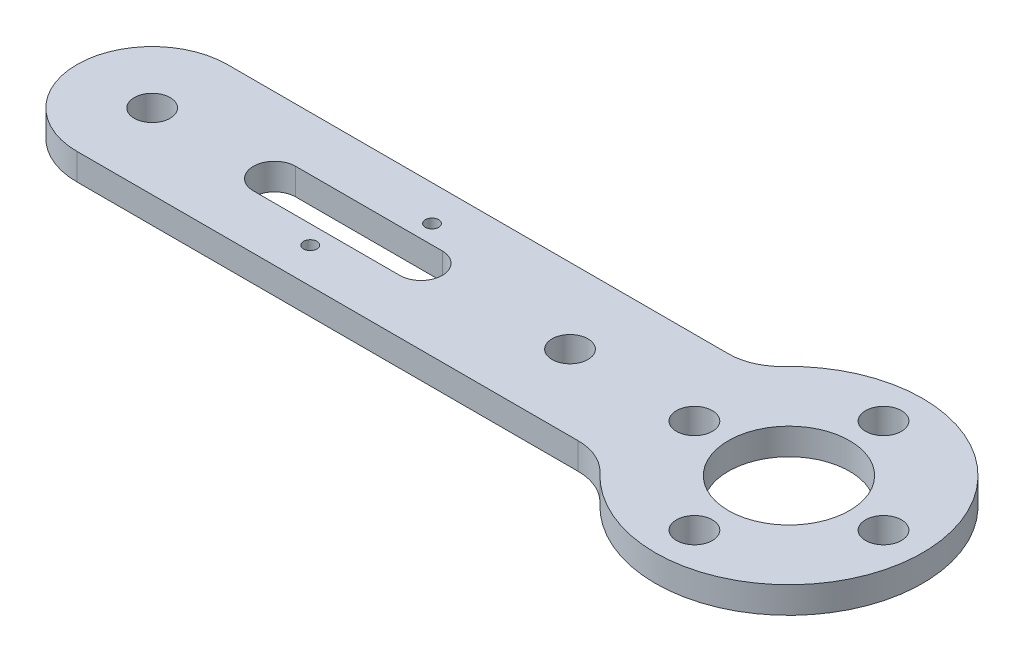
ISO-10303-21;
HEADER;
FILE_DESCRIPTION(('STEP AP214'),'2;1');
FILE_NAME('part.step','',(''),(''),'','','');
FILE_SCHEMA(('AUTOMOTIVE_DESIGN { 1 0 10303 214 1 1 1 1 }'));
ENDSEC;
DATA;
#1=APPLICATION_CONTEXT('core data for automotive mechanical design processes');
#2=APPLICATION_PROTOCOL_DEFINITION('international standard','automotive_design',2000,#1);
#3=PRODUCT_CONTEXT('',#1,'mechanical');
#4=PRODUCT('Part','Part','',(#3));
#5=PRODUCT_RELATED_PRODUCT_CATEGORY('part','',(#4));
#6=PRODUCT_DEFINITION_FORMATION('','',#4);
#7=PRODUCT_DEFINITION_CONTEXT('part definition',#1,'design');
#8=PRODUCT_DEFINITION('design','',#6,#7);
#9=PRODUCT_DEFINITION_SHAPE('','',#8);
#10=(LENGTH_UNIT() NAMED_UNIT(*) SI_UNIT(.MILLI.,.METRE.));
#11=(NAMED_UNIT(*) PLANE_ANGLE_UNIT() SI_UNIT($,.RADIAN.));
#12=(NAMED_UNIT(*) SI_UNIT($,.STERADIAN.) SOLID_ANGLE_UNIT());
#13=UNCERTAINTY_MEASURE_WITH_UNIT(LENGTH_MEASURE(1.E-05),#10,'distance_accuracy_value','');
#14=(GEOMETRIC_REPRESENTATION_CONTEXT(3) GLOBAL_UNCERTAINTY_ASSIGNED_CONTEXT((#13)) GLOBAL_UNIT_ASSIGNED_CONTEXT((#10,
#11,#12)) REPRESENTATION_CONTEXT('',''));
#15=CARTESIAN_POINT('',(0.,0.,0.));
#16=DIRECTION('',(0.,0.,1.));
#17=DIRECTION('',(1.,0.,0.));
#18=AXIS2_PLACEMENT_3D('',#15,#16,#17);
#19=CARTESIAN_POINT('',(-76.2,3.175,0.));
#20=DIRECTION('',(0.,1.,0.));
#21=DIRECTION('',(0.,0.,1.));
#22=AXIS2_PLACEMENT_3D('',#19,#20,#21);
#23=PLANE('',#22);
#24=CARTESIAN_POINT('',(-47.48134,3.175,-4.76218000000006));
#25=DIRECTION('',(0.,1.,0.));
#26=DIRECTION('',(0.,0.,1.));
#27=AXIS2_PLACEMENT_3D('',#24,#25,#26);
#28=CIRCLE('',#27,0.799999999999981);
#29=CARTESIAN_POINT('',(-47.48134,3.175,-3.96218000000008));
#30=VERTEX_POINT('',#29);
#31=EDGE_CURVE('E354',#30,#30,#28,.T.);
#32=ORIENTED_EDGE('',*,*,#31,.F.);
#33=EDGE_LOOP('',(#32));
#34=FACE_BOUND('',#33,.T.);
#35=CARTESIAN_POINT('',(-52.5207,3.175,4.76281999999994));
#36=DIRECTION('',(0.,1.,0.));
#37=DIRECTION('',(0.,0.,1.));
#38=AXIS2_PLACEMENT_3D('',#35,#36,#37);
#39=CIRCLE('',#38,0.799999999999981);
#40=CARTESIAN_POINT('',(-52.5207,3.175,5.56281999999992));
#41=VERTEX_POINT('',#40);
#42=EDGE_CURVE('E356',#41,#41,#39,.T.);
#43=ORIENTED_EDGE('',*,*,#42,.F.);
#44=EDGE_LOOP('',(#43));
#45=FACE_BOUND('',#44,.T.);
#46=CARTESIAN_POINT('',(-44.02694,3.175,0.));
#47=DIRECTION('',(0.,1.,0.));
#48=DIRECTION('',(0.,0.,1.));
#49=AXIS2_PLACEMENT_3D('',#46,#47,#48);
#50=CIRCLE('',#49,2.54);
#51=CARTESIAN_POINT('',(-44.02694,3.175,2.54));
#52=VERTEX_POINT('',#51);
#53=CARTESIAN_POINT('',(-44.02694,3.175,-2.54));
#54=VERTEX_POINT('',#53);
#55=EDGE_CURVE('E57',#52,#54,#50,.T.);
#56=ORIENTED_EDGE('',*,*,#55,.F.);
#57=DIRECTION('',(1.,0.,0.));
#58=VECTOR('',#57,1.);
#59=CARTESIAN_POINT('',(-44.02694,3.175,2.54));
#60=LINE('',#59,#58);
#61=CARTESIAN_POINT('',(-61.56106,3.175,2.54));
#62=VERTEX_POINT('',#61);
#63=EDGE_CURVE('E136',#62,#52,#60,.T.);
#64=ORIENTED_EDGE('',*,*,#63,.F.);
#65=CARTESIAN_POINT('',(-61.56106,3.175,0.));
#66=DIRECTION('',(0.,1.,0.));
#67=DIRECTION('',(0.,0.,1.));
#68=AXIS2_PLACEMENT_3D('',#65,#66,#67);
#69=CIRCLE('',#68,2.54);
#70=CARTESIAN_POINT('',(-61.56106,3.175,-2.54));
#71=VERTEX_POINT('',#70);
#72=EDGE_CURVE('E139',#71,#62,#69,.T.);
#73=ORIENTED_EDGE('',*,*,#72,.F.);
#74=DIRECTION('',(-1.,0.,0.));
#75=VECTOR('',#74,1.);
#76=CARTESIAN_POINT('',(-44.02694,3.175,-2.54));
#77=LINE('',#76,#75);
#78=EDGE_CURVE('E148',#54,#71,#77,.T.);
#79=ORIENTED_EDGE('',*,*,#78,.F.);
#80=EDGE_LOOP('',(#56,#64,#73,#79));
#81=FACE_BOUND('',#80,.T.);
#82=CARTESIAN_POINT('',(-76.2,3.175,0.));
#83=DIRECTION('',(0.,1.,0.));
#84=DIRECTION('',(0.,0.,1.));
#85=AXIS2_PLACEMENT_3D('',#82,#83,#84);
#86=CIRCLE('',#85,2.15);
#87=CARTESIAN_POINT('',(-76.2,3.175,2.15));
#88=VERTEX_POINT('',#87);
#89=EDGE_CURVE('E154',#88,#88,#86,.T.);
#90=ORIENTED_EDGE('',*,*,#89,.F.);
#91=EDGE_LOOP('',(#90));
#92=FACE_BOUND('',#91,.T.);
#93=CARTESIAN_POINT('',(-26.2,3.175,0.));
#94=DIRECTION('',(0.,1.,0.));
#95=DIRECTION('',(0.,0.,1.));
#96=AXIS2_PLACEMENT_3D('',#93,#94,#95);
#97=CIRCLE('',#96,2.15);
#98=CARTESIAN_POINT('',(-26.2,3.175,2.15));
#99=VERTEX_POINT('',#98);
#100=EDGE_CURVE('E163',#99,#99,#97,.T.);
#101=ORIENTED_EDGE('',*,*,#100,.F.);
#102=EDGE_LOOP('',(#101));
#103=FACE_BOUND('',#102,.T.);
#104=CARTESIAN_POINT('',(0.,3.175,-11.3137084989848));
#105=DIRECTION('',(0.,1.,0.));
#106=DIRECTION('',(0.,0.,1.));
#107=AXIS2_PLACEMENT_3D('',#104,#105,#106);
#108=CIRCLE('',#107,2.15);
#109=CARTESIAN_POINT('',(0.,3.175,-9.16370849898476));
#110=VERTEX_POINT('',#109);
#111=EDGE_CURVE('E169',#110,#110,#108,.T.);
#112=ORIENTED_EDGE('',*,*,#111,.F.);
#113=EDGE_LOOP('',(#112));
#114=FACE_BOUND('',#113,.T.);
#115=CARTESIAN_POINT('',(0.,3.175,11.3137084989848));
#116=DIRECTION('',(0.,1.,0.));
#117=DIRECTION('',(0.,0.,1.));
#118=AXIS2_PLACEMENT_3D('',#115,#116,#117);
#119=CIRCLE('',#118,2.15);
#120=CARTESIAN_POINT('',(0.,3.175,13.4637084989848));
#121=VERTEX_POINT('',#120);
#122=EDGE_CURVE('E175',#121,#121,#119,.T.);
#123=ORIENTED_EDGE('',*,*,#122,.F.);
#124=EDGE_LOOP('',(#123));
#125=FACE_BOUND('',#124,.T.);
#126=CARTESIAN_POINT('',(11.3137084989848,3.175,0.));
#127=DIRECTION('',(0.,1.,0.));
#128=DIRECTION('',(0.,0.,1.));
#129=AXIS2_PLACEMENT_3D('',#126,#127,#128);
#130=CIRCLE('',#129,2.15);
#131=CARTESIAN_POINT('',(11.3137084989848,3.175,2.15));
#132=VERTEX_POINT('',#131);
#133=EDGE_CURVE('E181',#132,#132,#130,.T.);
#134=ORIENTED_EDGE('',*,*,#133,.F.);
#135=EDGE_LOOP('',(#134));
#136=FACE_BOUND('',#135,.T.);
#137=CARTESIAN_POINT('',(-11.3137084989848,3.175,0.));
#138=DIRECTION('',(0.,1.,0.));
#139=DIRECTION('',(0.,0.,1.));
#140=AXIS2_PLACEMENT_3D('',#137,#138,#139);
#141=CIRCLE('',#140,2.15);
#142=CARTESIAN_POINT('',(-11.3137084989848,3.175,2.15));
#143=VERTEX_POINT('',#142);
#144=EDGE_CURVE('E187',#143,#143,#141,.T.);
#145=ORIENTED_EDGE('',*,*,#144,.F.);
#146=EDGE_LOOP('',(#145));
#147=FACE_BOUND('',#146,.T.);
#148=CARTESIAN_POINT('',(-76.2,3.175,0.));
#149=DIRECTION('',(0.,1.,0.));
#150=DIRECTION('',(0.,0.,1.));
#151=AXIS2_PLACEMENT_3D('',#148,#149,#150);
#152=CIRCLE('',#151,9.);
#153=CARTESIAN_POINT('',(-76.2,3.175,-9.));
#154=VERTEX_POINT('',#153);
#155=CARTESIAN_POINT('',(-76.2,3.175,9.));
#156=VERTEX_POINT('',#155);
#157=EDGE_CURVE('E200',#154,#156,#152,.T.);
#158=ORIENTED_EDGE('',*,*,#157,.T.);
#159=DIRECTION('',(1.,0.,0.));
#160=VECTOR('',#159,1.);
#161=CARTESIAN_POINT('',(-13.228756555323,3.175,9.));
#162=LINE('',#161,#160);
#163=CARTESIAN_POINT('',(-16.2449992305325,3.175,9.));
#164=VERTEX_POINT('',#163);
#165=EDGE_CURVE('E203',#156,#164,#162,.T.);
#166=ORIENTED_EDGE('',*,*,#165,.T.);
#167=CARTESIAN_POINT('',(-16.2449992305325,3.175,15.35));
#168=DIRECTION('',(0.,1.,0.));
#169=DIRECTION('',(0.,0.,1.));
#170=AXIS2_PLACEMENT_3D('',#167,#168,#169);
#171=CIRCLE('',#170,6.35);
#172=CARTESIAN_POINT('',(-11.629529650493,3.175,10.9888143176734));
#173=VERTEX_POINT('',#172);
#174=EDGE_CURVE('E239',#164,#173,#171,.F.);
#175=ORIENTED_EDGE('',*,*,#174,.T.);
#176=CARTESIAN_POINT('',(0.,3.175,0.));
#177=DIRECTION('',(0.,1.,0.));
#178=DIRECTION('',(0.,0.,1.));
#179=AXIS2_PLACEMENT_3D('',#176,#177,#178);
#180=CIRCLE('',#179,16.);
#181=CARTESIAN_POINT('',(-11.629529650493,3.175,-10.9888143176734));
#182=VERTEX_POINT('',#181);
#183=EDGE_CURVE('E207',#173,#182,#180,.T.);
#184=ORIENTED_EDGE('',*,*,#183,.T.);
#185=CARTESIAN_POINT('',(-16.2449992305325,3.175,-15.35));
#186=DIRECTION('',(0.,1.,0.));
#187=DIRECTION('',(0.,0.,1.));
#188=AXIS2_PLACEMENT_3D('',#185,#186,#187);
#189=CIRCLE('',#188,6.35);
#190=CARTESIAN_POINT('',(-16.2449992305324,3.175,-9.));
#191=VERTEX_POINT('',#190);
#192=EDGE_CURVE('E11',#182,#191,#189,.F.);
#193=ORIENTED_EDGE('',*,*,#192,.T.);
#194=DIRECTION('',(-1.,0.,0.));
#195=VECTOR('',#194,1.);
#196=CARTESIAN_POINT('',(-76.2,3.175,-9.));
#197=LINE('',#196,#195);
#198=EDGE_CURVE('E210',#191,#154,#197,.T.);
#199=ORIENTED_EDGE('',*,*,#198,.T.);
#200=EDGE_LOOP('',(#158,#166,#175,#184,#193,#199));
#201=FACE_BOUND('',#200,.T.);
#202=CARTESIAN_POINT('',(0.,3.175,0.));
#203=DIRECTION('',(0.,1.,0.));
#204=DIRECTION('',(0.,0.,1.));
#205=AXIS2_PLACEMENT_3D('',#202,#203,#204);
#206=CIRCLE('',#205,7.25);
#207=CARTESIAN_POINT('',(0.,3.175,7.25));
#208=VERTEX_POINT('',#207);
#209=EDGE_CURVE('E194',#208,#208,#206,.T.);
#210=ORIENTED_EDGE('',*,*,#209,.F.);
#211=EDGE_LOOP('',(#210));
#212=FACE_BOUND('',#211,.T.);
#213=ADVANCED_FACE('F42',(#34,#45,#81,#92,#103,#114,#125,#136,#147,#201,#212),#23,.T.);
#214=CARTESIAN_POINT('',(-76.2,0.,0.));
#215=DIRECTION('',(0.,1.,0.));
#216=DIRECTION('',(0.,0.,1.));
#217=AXIS2_PLACEMENT_3D('',#214,#215,#216);
#218=PLANE('',#217);
#219=CARTESIAN_POINT('',(-47.48134,0.,-4.76218000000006));
#220=DIRECTION('',(0.,1.,0.));
#221=DIRECTION('',(0.,0.,1.));
#222=AXIS2_PLACEMENT_3D('',#219,#220,#221);
#223=CIRCLE('',#222,0.799999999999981);
#224=CARTESIAN_POINT('',(-47.48134,0.,-3.96218000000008));
#225=VERTEX_POINT('',#224);
#226=EDGE_CURVE('E352',#225,#225,#223,.T.);
#227=ORIENTED_EDGE('',*,*,#226,.T.);
#228=EDGE_LOOP('',(#227));
#229=FACE_BOUND('',#228,.T.);
#230=CARTESIAN_POINT('',(-52.5207,0.,4.76281999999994));
#231=DIRECTION('',(0.,1.,0.));
#232=DIRECTION('',(0.,0.,1.));
#233=AXIS2_PLACEMENT_3D('',#230,#231,#232);
#234=CIRCLE('',#233,0.799999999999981);
#235=CARTESIAN_POINT('',(-52.5207,0.,5.56281999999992));
#236=VERTEX_POINT('',#235);
#237=EDGE_CURVE('E142',#236,#236,#234,.T.);
#238=ORIENTED_EDGE('',*,*,#237,.T.);
#239=EDGE_LOOP('',(#238));
#240=FACE_BOUND('',#239,.T.);
#241=DIRECTION('',(1.,0.,0.));
#242=VECTOR('',#241,1.);
#243=CARTESIAN_POINT('',(-44.02694,0.,2.54));
#244=LINE('',#243,#242);
#245=CARTESIAN_POINT('',(-61.56106,0.,2.54));
#246=VERTEX_POINT('',#245);
#247=CARTESIAN_POINT('',(-44.02694,0.,2.54));
#248=VERTEX_POINT('',#247);
#249=EDGE_CURVE('E126',#246,#248,#244,.T.);
#250=ORIENTED_EDGE('',*,*,#249,.T.);
#251=CARTESIAN_POINT('',(-44.02694,0.,0.));
#252=DIRECTION('',(0.,1.,0.));
#253=DIRECTION('',(0.,0.,1.));
#254=AXIS2_PLACEMENT_3D('',#251,#252,#253);
#255=CIRCLE('',#254,2.54);
#256=CARTESIAN_POINT('',(-44.02694,0.,-2.54));
#257=VERTEX_POINT('',#256);
#258=EDGE_CURVE('E120',#248,#257,#255,.T.);
#259=ORIENTED_EDGE('',*,*,#258,.T.);
#260=DIRECTION('',(-1.,0.,0.));
#261=VECTOR('',#260,1.);
#262=CARTESIAN_POINT('',(-44.02694,0.,-2.54));
#263=LINE('',#262,#261);
#264=CARTESIAN_POINT('',(-61.56106,0.,-2.54));
#265=VERTEX_POINT('',#264);
#266=EDGE_CURVE('E129',#257,#265,#263,.T.);
#267=ORIENTED_EDGE('',*,*,#266,.T.);
#268=CARTESIAN_POINT('',(-61.56106,0.,0.));
#269=DIRECTION('',(0.,1.,0.));
#270=DIRECTION('',(0.,0.,1.));
#271=AXIS2_PLACEMENT_3D('',#268,#269,#270);
#272=CIRCLE('',#271,2.54);
#273=EDGE_CURVE('E65',#265,#246,#272,.T.);
#274=ORIENTED_EDGE('',*,*,#273,.T.);
#275=EDGE_LOOP('',(#250,#259,#267,#274));
#276=FACE_BOUND('',#275,.T.);
#277=CARTESIAN_POINT('',(-76.2,0.,0.));
#278=DIRECTION('',(0.,1.,0.));
#279=DIRECTION('',(0.,0.,1.));
#280=AXIS2_PLACEMENT_3D('',#277,#278,#279);
#281=CIRCLE('',#280,2.15);
#282=CARTESIAN_POINT('',(-76.2,0.,2.15));
#283=VERTEX_POINT('',#282);
#284=EDGE_CURVE('E160',#283,#283,#281,.T.);
#285=ORIENTED_EDGE('',*,*,#284,.T.);
#286=EDGE_LOOP('',(#285));
#287=FACE_BOUND('',#286,.T.);
#288=CARTESIAN_POINT('',(-26.2,0.,0.));
#289=DIRECTION('',(0.,1.,0.));
#290=DIRECTION('',(0.,0.,1.));
#291=AXIS2_PLACEMENT_3D('',#288,#289,#290);
#292=CIRCLE('',#291,2.15);
#293=CARTESIAN_POINT('',(-26.2,0.,2.15));
#294=VERTEX_POINT('',#293);
#295=EDGE_CURVE('E166',#294,#294,#292,.T.);
#296=ORIENTED_EDGE('',*,*,#295,.T.);
#297=EDGE_LOOP('',(#296));
#298=FACE_BOUND('',#297,.T.);
#299=CARTESIAN_POINT('',(0.,0.,-11.3137084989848));
#300=DIRECTION('',(0.,1.,0.));
#301=DIRECTION('',(0.,0.,1.));
#302=AXIS2_PLACEMENT_3D('',#299,#300,#301);
#303=CIRCLE('',#302,2.15);
#304=CARTESIAN_POINT('',(0.,0.,-9.16370849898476));
#305=VERTEX_POINT('',#304);
#306=EDGE_CURVE('E172',#305,#305,#303,.T.);
#307=ORIENTED_EDGE('',*,*,#306,.T.);
#308=EDGE_LOOP('',(#307));
#309=FACE_BOUND('',#308,.T.);
#310=CARTESIAN_POINT('',(0.,0.,11.3137084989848));
#311=DIRECTION('',(0.,1.,0.));
#312=DIRECTION('',(0.,0.,1.));
#313=AXIS2_PLACEMENT_3D('',#310,#311,#312);
#314=CIRCLE('',#313,2.15);
#315=CARTESIAN_POINT('',(0.,0.,13.4637084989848));
#316=VERTEX_POINT('',#315);
#317=EDGE_CURVE('E178',#316,#316,#314,.T.);
#318=ORIENTED_EDGE('',*,*,#317,.T.);
#319=EDGE_LOOP('',(#318));
#320=FACE_BOUND('',#319,.T.);
#321=CARTESIAN_POINT('',(11.3137084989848,0.,0.));
#322=DIRECTION('',(0.,1.,0.));
#323=DIRECTION('',(0.,0.,1.));
#324=AXIS2_PLACEMENT_3D('',#321,#322,#323);
#325=CIRCLE('',#324,2.15);
#326=CARTESIAN_POINT('',(11.3137084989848,0.,2.15));
#327=VERTEX_POINT('',#326);
#328=EDGE_CURVE('E184',#327,#327,#325,.T.);
#329=ORIENTED_EDGE('',*,*,#328,.T.);
#330=EDGE_LOOP('',(#329));
#331=FACE_BOUND('',#330,.T.);
#332=CARTESIAN_POINT('',(-11.3137084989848,0.,0.));
#333=DIRECTION('',(0.,1.,0.));
#334=DIRECTION('',(0.,0.,1.));
#335=AXIS2_PLACEMENT_3D('',#332,#333,#334);
#336=CIRCLE('',#335,2.15);
#337=CARTESIAN_POINT('',(-11.3137084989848,0.,2.15));
#338=VERTEX_POINT('',#337);
#339=EDGE_CURVE('E190',#338,#338,#336,.T.);
#340=ORIENTED_EDGE('',*,*,#339,.T.);
#341=EDGE_LOOP('',(#340));
#342=FACE_BOUND('',#341,.T.);
#343=CARTESIAN_POINT('',(-76.2,0.,0.));
#344=DIRECTION('',(0.,1.,0.));
#345=DIRECTION('',(0.,0.,1.));
#346=AXIS2_PLACEMENT_3D('',#343,#344,#345);
#347=CIRCLE('',#346,9.);
#348=CARTESIAN_POINT('',(-76.2,0.,-9.));
#349=VERTEX_POINT('',#348);
#350=CARTESIAN_POINT('',(-76.2,0.,9.));
#351=VERTEX_POINT('',#350);
#352=EDGE_CURVE('E197',#349,#351,#347,.T.);
#353=ORIENTED_EDGE('',*,*,#352,.F.);
#354=DIRECTION('',(-1.,0.,0.));
#355=VECTOR('',#354,1.);
#356=CARTESIAN_POINT('',(-76.2,0.,-9.));
#357=LINE('',#356,#355);
#358=CARTESIAN_POINT('',(-16.2449992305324,0.,-9.));
#359=VERTEX_POINT('',#358);
#360=EDGE_CURVE('E204',#359,#349,#357,.T.);
#361=ORIENTED_EDGE('',*,*,#360,.F.);
#362=CARTESIAN_POINT('',(-16.2449992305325,0.,-15.35));
#363=DIRECTION('',(0.,1.,0.));
#364=DIRECTION('',(0.,0.,1.));
#365=AXIS2_PLACEMENT_3D('',#362,#363,#364);
#366=CIRCLE('',#365,6.35);
#367=CARTESIAN_POINT('',(-11.629529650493,0.,-10.9888143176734));
#368=VERTEX_POINT('',#367);
#369=EDGE_CURVE('E50',#359,#368,#366,.T.);
#370=ORIENTED_EDGE('',*,*,#369,.T.);
#371=CARTESIAN_POINT('',(0.,0.,0.));
#372=DIRECTION('',(0.,1.,0.));
#373=DIRECTION('',(0.,0.,1.));
#374=AXIS2_PLACEMENT_3D('',#371,#372,#373);
#375=CIRCLE('',#374,16.);
#376=CARTESIAN_POINT('',(-11.629529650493,0.,10.9888143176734));
#377=VERTEX_POINT('',#376);
#378=EDGE_CURVE('E218',#377,#368,#375,.T.);
#379=ORIENTED_EDGE('',*,*,#378,.F.);
#380=CARTESIAN_POINT('',(-16.2449992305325,0.,15.35));
#381=DIRECTION('',(0.,1.,0.));
#382=DIRECTION('',(0.,0.,1.));
#383=AXIS2_PLACEMENT_3D('',#380,#381,#382);
#384=CIRCLE('',#383,6.35);
#385=CARTESIAN_POINT('',(-16.2449992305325,0.,9.));
#386=VERTEX_POINT('',#385);
#387=EDGE_CURVE('E237',#377,#386,#384,.T.);
#388=ORIENTED_EDGE('',*,*,#387,.T.);
#389=DIRECTION('',(1.,0.,0.));
#390=VECTOR('',#389,1.);
#391=CARTESIAN_POINT('',(-13.228756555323,0.,9.));
#392=LINE('',#391,#390);
#393=EDGE_CURVE('E215',#351,#386,#392,.T.);
#394=ORIENTED_EDGE('',*,*,#393,.F.);
#395=EDGE_LOOP('',(#353,#361,#370,#379,#388,#394));
#396=FACE_BOUND('',#395,.T.);
#397=CARTESIAN_POINT('',(0.,0.,0.));
#398=DIRECTION('',(0.,1.,0.));
#399=DIRECTION('',(0.,0.,1.));
#400=AXIS2_PLACEMENT_3D('',#397,#398,#399);
#401=CIRCLE('',#400,7.25);
#402=CARTESIAN_POINT('',(0.,0.,7.25));
#403=VERTEX_POINT('',#402);
#404=EDGE_CURVE('E193',#403,#403,#401,.T.);
#405=ORIENTED_EDGE('',*,*,#404,.T.);
#406=EDGE_LOOP('',(#405));
#407=FACE_BOUND('',#406,.T.);
#408=ADVANCED_FACE('F133',(#229,#240,#276,#287,#298,#309,#320,#331,#342,#396,#407),#218,.F.);
#409=CARTESIAN_POINT('',(-76.2,3.175,0.));
#410=DIRECTION('',(0.,-1.,0.));
#411=DIRECTION('',(0.,0.,-1.));
#412=AXIS2_PLACEMENT_3D('',#409,#410,#411);
#413=CYLINDRICAL_SURFACE('',#412,9.);
#414=ORIENTED_EDGE('',*,*,#352,.T.);
#415=DIRECTION('',(0.,-1.,0.));
#416=VECTOR('',#415,1.);
#417=CARTESIAN_POINT('',(-76.2,3.175,9.));
#418=LINE('',#417,#416);
#419=EDGE_CURVE('E224',#156,#351,#418,.T.);
#420=ORIENTED_EDGE('',*,*,#419,.F.);
#421=ORIENTED_EDGE('',*,*,#157,.F.);
#422=DIRECTION('',(0.,-1.,0.));
#423=VECTOR('',#422,1.);
#424=CARTESIAN_POINT('',(-76.2,3.175,-9.));
#425=LINE('',#424,#423);
#426=EDGE_CURVE('E212',#154,#349,#425,.T.);
#427=ORIENTED_EDGE('',*,*,#426,.T.);
#428=EDGE_LOOP('',(#414,#420,#421,#427));
#429=FACE_BOUND('',#428,.T.);
#430=ADVANCED_FACE('F262',(#429),#413,.T.);
#431=CARTESIAN_POINT('',(-13.228756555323,3.175,9.));
#432=DIRECTION('',(0.,0.,-1.));
#433=DIRECTION('',(-1.,0.,0.));
#434=AXIS2_PLACEMENT_3D('',#431,#432,#433);
#435=PLANE('',#434);
#436=ORIENTED_EDGE('',*,*,#393,.T.);
#437=DIRECTION('',(0.,1.,0.));
#438=VECTOR('',#437,1.);
#439=CARTESIAN_POINT('',(-16.2449992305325,3.175,9.));
#440=LINE('',#439,#438);
#441=EDGE_CURVE('E232',#386,#164,#440,.T.);
#442=ORIENTED_EDGE('',*,*,#441,.T.);
#443=ORIENTED_EDGE('',*,*,#165,.F.);
#444=ORIENTED_EDGE('',*,*,#419,.T.);
#445=EDGE_LOOP('',(#436,#442,#443,#444));
#446=FACE_BOUND('',#445,.T.);
#447=ADVANCED_FACE('F268',(#446),#435,.F.);
#448=CARTESIAN_POINT('',(0.,3.175,0.));
#449=DIRECTION('',(0.,-1.,0.));
#450=DIRECTION('',(0.,0.,-1.));
#451=AXIS2_PLACEMENT_3D('',#448,#449,#450);
#452=CYLINDRICAL_SURFACE('',#451,16.);
#453=ORIENTED_EDGE('',*,*,#183,.F.);
#454=DIRECTION('',(0.,-1.,0.));
#455=VECTOR('',#454,1.);
#456=CARTESIAN_POINT('',(-11.629529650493,3.175,10.9888143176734));
#457=LINE('',#456,#455);
#458=EDGE_CURVE('E229',#173,#377,#457,.T.);
#459=ORIENTED_EDGE('',*,*,#458,.T.);
#460=ORIENTED_EDGE('',*,*,#378,.T.);
#461=DIRECTION('',(0.,-1.,0.));
#462=VECTOR('',#461,1.);
#463=CARTESIAN_POINT('',(-11.629529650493,3.175,-10.9888143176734));
#464=LINE('',#463,#462);
#465=EDGE_CURVE('E227',#368,#182,#464,.F.);
#466=ORIENTED_EDGE('',*,*,#465,.T.);
#467=EDGE_LOOP('',(#453,#459,#460,#466));
#468=FACE_BOUND('',#467,.T.);
#469=ADVANCED_FACE('F250',(#468),#452,.T.);
#470=CARTESIAN_POINT('',(-76.2,3.175,-9.));
#471=DIRECTION('',(0.,0.,1.));
#472=DIRECTION('',(1.,0.,0.));
#473=AXIS2_PLACEMENT_3D('',#470,#471,#472);
#474=PLANE('',#473);
#475=ORIENTED_EDGE('',*,*,#198,.F.);
#476=DIRECTION('',(0.,1.,0.));
#477=VECTOR('',#476,1.);
#478=CARTESIAN_POINT('',(-16.2449992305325,0.,-9.));
#479=LINE('',#478,#477);
#480=EDGE_CURVE('E234',#191,#359,#479,.F.);
#481=ORIENTED_EDGE('',*,*,#480,.T.);
#482=ORIENTED_EDGE('',*,*,#360,.T.);
#483=ORIENTED_EDGE('',*,*,#426,.F.);
#484=EDGE_LOOP('',(#475,#481,#482,#483));
#485=FACE_BOUND('',#484,.T.);
#486=ADVANCED_FACE('F258',(#485),#474,.F.);
#487=CARTESIAN_POINT('',(0.,3.175,0.));
#488=DIRECTION('',(0.,-1.,0.));
#489=DIRECTION('',(0.,0.,-1.));
#490=AXIS2_PLACEMENT_3D('',#487,#488,#489);
#491=CYLINDRICAL_SURFACE('',#490,7.25);
#492=ORIENTED_EDGE('',*,*,#209,.T.);
#493=EDGE_LOOP('',(#492));
#494=FACE_BOUND('',#493,.T.);
#495=ORIENTED_EDGE('',*,*,#404,.F.);
#496=EDGE_LOOP('',(#495));
#497=FACE_BOUND('',#496,.T.);
#498=ADVANCED_FACE('F288',(#494,#497),#491,.F.);
#499=CARTESIAN_POINT('',(-11.3137084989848,3.175,0.));
#500=DIRECTION('',(0.,1.,0.));
#501=DIRECTION('',(0.,0.,1.));
#502=AXIS2_PLACEMENT_3D('',#499,#500,#501);
#503=CYLINDRICAL_SURFACE('',#502,2.15);
#504=ORIENTED_EDGE('',*,*,#339,.F.);
#505=EDGE_LOOP('',(#504));
#506=FACE_BOUND('',#505,.T.);
#507=ORIENTED_EDGE('',*,*,#144,.T.);
#508=EDGE_LOOP('',(#507));
#509=FACE_BOUND('',#508,.T.);
#510=ADVANCED_FACE('F295',(#506,#509),#503,.F.);
#511=CARTESIAN_POINT('',(11.3137084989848,3.175,0.));
#512=DIRECTION('',(0.,1.,0.));
#513=DIRECTION('',(0.,0.,1.));
#514=AXIS2_PLACEMENT_3D('',#511,#512,#513);
#515=CYLINDRICAL_SURFACE('',#514,2.15);
#516=ORIENTED_EDGE('',*,*,#328,.F.);
#517=EDGE_LOOP('',(#516));
#518=FACE_BOUND('',#517,.T.);
#519=ORIENTED_EDGE('',*,*,#133,.T.);
#520=EDGE_LOOP('',(#519));
#521=FACE_BOUND('',#520,.T.);
#522=ADVANCED_FACE('F300',(#518,#521),#515,.F.);
#523=CARTESIAN_POINT('',(0.,3.175,11.3137084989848));
#524=DIRECTION('',(0.,1.,0.));
#525=DIRECTION('',(0.,0.,1.));
#526=AXIS2_PLACEMENT_3D('',#523,#524,#525);
#527=CYLINDRICAL_SURFACE('',#526,2.15);
#528=ORIENTED_EDGE('',*,*,#317,.F.);
#529=EDGE_LOOP('',(#528));
#530=FACE_BOUND('',#529,.T.);
#531=ORIENTED_EDGE('',*,*,#122,.T.);
#532=EDGE_LOOP('',(#531));
#533=FACE_BOUND('',#532,.T.);
#534=ADVANCED_FACE('F308',(#530,#533),#527,.F.);
#535=CARTESIAN_POINT('',(0.,3.175,-11.3137084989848));
#536=DIRECTION('',(0.,1.,0.));
#537=DIRECTION('',(0.,0.,1.));
#538=AXIS2_PLACEMENT_3D('',#535,#536,#537);
#539=CYLINDRICAL_SURFACE('',#538,2.15);
#540=ORIENTED_EDGE('',*,*,#306,.F.);
#541=EDGE_LOOP('',(#540));
#542=FACE_BOUND('',#541,.T.);
#543=ORIENTED_EDGE('',*,*,#111,.T.);
#544=EDGE_LOOP('',(#543));
#545=FACE_BOUND('',#544,.T.);
#546=ADVANCED_FACE('F316',(#542,#545),#539,.F.);
#547=CARTESIAN_POINT('',(-26.2,3.175,0.));
#548=DIRECTION('',(0.,1.,0.));
#549=DIRECTION('',(0.,0.,1.));
#550=AXIS2_PLACEMENT_3D('',#547,#548,#549);
#551=CYLINDRICAL_SURFACE('',#550,2.15);
#552=ORIENTED_EDGE('',*,*,#295,.F.);
#553=EDGE_LOOP('',(#552));
#554=FACE_BOUND('',#553,.T.);
#555=ORIENTED_EDGE('',*,*,#100,.T.);
#556=EDGE_LOOP('',(#555));
#557=FACE_BOUND('',#556,.T.);
#558=ADVANCED_FACE('F320',(#554,#557),#551,.F.);
#559=CARTESIAN_POINT('',(-76.2,3.175,0.));
#560=DIRECTION('',(0.,1.,0.));
#561=DIRECTION('',(0.,0.,1.));
#562=AXIS2_PLACEMENT_3D('',#559,#560,#561);
#563=CYLINDRICAL_SURFACE('',#562,2.15);
#564=ORIENTED_EDGE('',*,*,#284,.F.);
#565=EDGE_LOOP('',(#564));
#566=FACE_BOUND('',#565,.T.);
#567=ORIENTED_EDGE('',*,*,#89,.T.);
#568=EDGE_LOOP('',(#567));
#569=FACE_BOUND('',#568,.T.);
#570=ADVANCED_FACE('F324',(#566,#569),#563,.F.);
#571=CARTESIAN_POINT('',(-16.2449992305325,3.175,15.35));
#572=DIRECTION('',(0.,-1.,0.));
#573=DIRECTION('',(0.,0.,-1.));
#574=AXIS2_PLACEMENT_3D('',#571,#572,#573);
#575=CYLINDRICAL_SURFACE('',#574,6.35);
#576=ORIENTED_EDGE('',*,*,#174,.F.);
#577=ORIENTED_EDGE('',*,*,#441,.F.);
#578=ORIENTED_EDGE('',*,*,#387,.F.);
#579=ORIENTED_EDGE('',*,*,#458,.F.);
#580=EDGE_LOOP('',(#576,#577,#578,#579));
#581=FACE_BOUND('',#580,.T.);
#582=ADVANCED_FACE('F267',(#581),#575,.F.);
#583=CARTESIAN_POINT('',(-16.2449992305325,3.175,-15.35));
#584=DIRECTION('',(0.,-1.,0.));
#585=DIRECTION('',(0.,0.,-1.));
#586=AXIS2_PLACEMENT_3D('',#583,#584,#585);
#587=CYLINDRICAL_SURFACE('',#586,6.35);
#588=ORIENTED_EDGE('',*,*,#192,.F.);
#589=ORIENTED_EDGE('',*,*,#465,.F.);
#590=ORIENTED_EDGE('',*,*,#369,.F.);
#591=ORIENTED_EDGE('',*,*,#480,.F.);
#592=EDGE_LOOP('',(#588,#589,#590,#591));
#593=FACE_BOUND('',#592,.T.);
#594=ADVANCED_FACE('F44',(#593),#587,.F.);
#595=CARTESIAN_POINT('',(-44.02694,0.,0.));
#596=DIRECTION('',(0.,1.,0.));
#597=DIRECTION('',(0.,0.,1.));
#598=AXIS2_PLACEMENT_3D('',#595,#596,#597);
#599=CYLINDRICAL_SURFACE('',#598,2.54);
#600=ORIENTED_EDGE('',*,*,#55,.T.);
#601=DIRECTION('',(0.,1.,0.));
#602=VECTOR('',#601,1.);
#603=CARTESIAN_POINT('',(-44.02694,0.,-2.54));
#604=LINE('',#603,#602);
#605=EDGE_CURVE('E116',#257,#54,#604,.T.);
#606=ORIENTED_EDGE('',*,*,#605,.F.);
#607=ORIENTED_EDGE('',*,*,#258,.F.);
#608=DIRECTION('',(0.,1.,0.));
#609=VECTOR('',#608,1.);
#610=CARTESIAN_POINT('',(-44.02694,0.,2.54));
#611=LINE('',#610,#609);
#612=EDGE_CURVE('E152',#248,#52,#611,.T.);
#613=ORIENTED_EDGE('',*,*,#612,.T.);
#614=EDGE_LOOP('',(#600,#606,#607,#613));
#615=FACE_BOUND('',#614,.T.);
#616=ADVANCED_FACE('F118',(#615),#599,.F.);
#617=CARTESIAN_POINT('',(-44.02694,0.,2.54));
#618=DIRECTION('',(0.,0.,1.));
#619=DIRECTION('',(1.,0.,0.));
#620=AXIS2_PLACEMENT_3D('',#617,#618,#619);
#621=PLANE('',#620);
#622=ORIENTED_EDGE('',*,*,#63,.T.);
#623=ORIENTED_EDGE('',*,*,#612,.F.);
#624=ORIENTED_EDGE('',*,*,#249,.F.);
#625=DIRECTION('',(0.,1.,0.));
#626=VECTOR('',#625,1.);
#627=CARTESIAN_POINT('',(-61.56106,0.,2.54));
#628=LINE('',#627,#626);
#629=EDGE_CURVE('E155',#246,#62,#628,.T.);
#630=ORIENTED_EDGE('',*,*,#629,.T.);
#631=EDGE_LOOP('',(#622,#623,#624,#630));
#632=FACE_BOUND('',#631,.T.);
#633=ADVANCED_FACE('F331',(#632),#621,.F.);
#634=CARTESIAN_POINT('',(-61.56106,0.,0.));
#635=DIRECTION('',(0.,1.,0.));
#636=DIRECTION('',(0.,0.,1.));
#637=AXIS2_PLACEMENT_3D('',#634,#635,#636);
#638=CYLINDRICAL_SURFACE('',#637,2.54);
#639=ORIENTED_EDGE('',*,*,#72,.T.);
#640=ORIENTED_EDGE('',*,*,#629,.F.);
#641=ORIENTED_EDGE('',*,*,#273,.F.);
#642=DIRECTION('',(0.,1.,0.));
#643=VECTOR('',#642,1.);
#644=CARTESIAN_POINT('',(-61.56106,0.,-2.54));
#645=LINE('',#644,#643);
#646=EDGE_CURVE('E125',#265,#71,#645,.T.);
#647=ORIENTED_EDGE('',*,*,#646,.T.);
#648=EDGE_LOOP('',(#639,#640,#641,#647));
#649=FACE_BOUND('',#648,.T.);
#650=ADVANCED_FACE('F335',(#649),#638,.F.);
#651=CARTESIAN_POINT('',(-44.02694,0.,-2.54));
#652=DIRECTION('',(0.,0.,-1.));
#653=DIRECTION('',(-1.,0.,0.));
#654=AXIS2_PLACEMENT_3D('',#651,#652,#653);
#655=PLANE('',#654);
#656=ORIENTED_EDGE('',*,*,#78,.T.);
#657=ORIENTED_EDGE('',*,*,#646,.F.);
#658=ORIENTED_EDGE('',*,*,#266,.F.);
#659=ORIENTED_EDGE('',*,*,#605,.T.);
#660=EDGE_LOOP('',(#656,#657,#658,#659));
#661=FACE_BOUND('',#660,.T.);
#662=ADVANCED_FACE('F130',(#661),#655,.F.);
#663=CARTESIAN_POINT('',(-52.5207,3.175,4.76281999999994));
#664=DIRECTION('',(0.,1.,0.));
#665=DIRECTION('',(0.,0.,1.));
#666=AXIS2_PLACEMENT_3D('',#663,#664,#665);
#667=CYLINDRICAL_SURFACE('',#666,0.799999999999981);
#668=ORIENTED_EDGE('',*,*,#237,.F.);
#669=EDGE_LOOP('',(#668));
#670=FACE_BOUND('',#669,.T.);
#671=ORIENTED_EDGE('',*,*,#42,.T.);
#672=EDGE_LOOP('',(#671));
#673=FACE_BOUND('',#672,.T.);
#674=ADVANCED_FACE('F334',(#670,#673),#667,.F.);
#675=CARTESIAN_POINT('',(-47.48134,3.175,-4.76218000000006));
#676=DIRECTION('',(0.,1.,0.));
#677=DIRECTION('',(0.,0.,1.));
#678=AXIS2_PLACEMENT_3D('',#675,#676,#677);
#679=CYLINDRICAL_SURFACE('',#678,0.799999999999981);
#680=ORIENTED_EDGE('',*,*,#226,.F.);
#681=EDGE_LOOP('',(#680));
#682=FACE_BOUND('',#681,.T.);
#683=ORIENTED_EDGE('',*,*,#31,.T.);
#684=EDGE_LOOP('',(#683));
#685=FACE_BOUND('',#684,.T.);
#686=ADVANCED_FACE('F343',(#682,#685),#679,.F.);
#687=CLOSED_SHELL('',(#213,#408,#430,#447,#469,#486,#498,#510,#522,#534,#546,#558,#570,#582,
#594,#616,#633,#650,#662,#674,#686));
#688=MANIFOLD_SOLID_BREP('B2',#687);
#689=ADVANCED_BREP_SHAPE_REPRESENTATION('',(#18,#688),#14);
#690=SHAPE_DEFINITION_REPRESENTATION(#9,#689);
ENDSEC;
END-ISO-10303-21;
